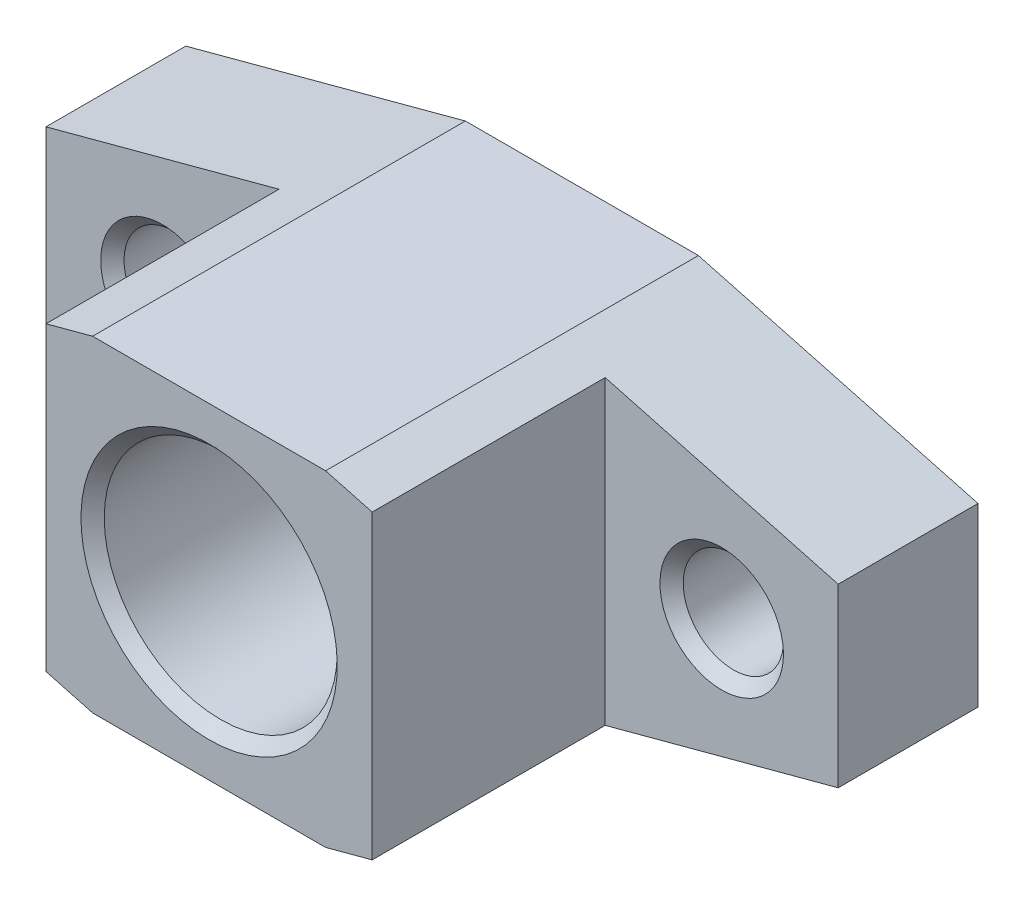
from build123d import *

# Parameters (mm, degrees)
EXTRUDE_1_DEPTH     = 6
EXTRUDE_2_DEPTH     = 16
HOLE_WIZARD_1_D     = 4.3
HOLE_WIZARD_1_DEPTH = 100
SKETCH_5_R          = 5
CUT_EXTRUDE_1_DEPTH = 25.372115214
CHAMFER_1_SIZE      = 0.5
CHAMFER_3_SIZE      = 0.5
MOVE_BODY_1_ANGLE   = 90


with BuildPart() as part:
    # Sketch 1 → Extrude 1 (new body)
    with BuildSketch(Plane(origin=(0, 0, 0), x_dir=(1, 0, 0), z_dir=(0, 1, 0))):
        Polygon((-5, 7), (5, 7), (17, 3.784609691), (17, -3.784609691), (5, -7), (-5, -7), (-17, -3.784609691), (-17, 3.784609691), align=None)
    extrude(amount=EXTRUDE_1_DEPTH)

    # Sketch 2 → Extrude 2 (add)
    with BuildSketch(Plane(origin=(0, 0, 0), x_dir=(-1, 0, 0), z_dir=(0, 1, 0))):
        Polygon((-5, 7), (5, 7), (7, 6.464101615), (7, -6.464101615), (5, -7), (-5, -7), (-7, -6.464101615), (-7, 6.464101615), align=None)
    extrude(amount=EXTRUDE_2_DEPTH)

    # Hole Wizard 1
    with Locations(Plane(origin=(0, 6, 0), x_dir=(-1, 0, 0), z_dir=(0, 1, 0))):
        with Locations((12, 0), (-12, 0)):
            Hole(HOLE_WIZARD_1_D / 2, depth=HOLE_WIZARD_1_DEPTH)

    # Sketch 5 → Cut-Extrude 1 (cut, through all)
    with BuildSketch(Plane(origin=(0, 16, 0), x_dir=(-1, 0, 0), z_dir=(0, 1, 0))):
        with Locations(Location((0, 0, 0), (0, 0, 90))):
            Circle(SKETCH_5_R)
    extrude(amount=-CUT_EXTRUDE_1_DEPTH, mode=Mode.SUBTRACT)

    # Chamfer 1
    chamfer_1_edges = [part.edges().sort_by_distance(p)[0] for p in [
        (0, 16, -5),
    ]]
    chamfer(chamfer_1_edges, length=CHAMFER_1_SIZE)

    # Chamfer 3
    chamfer_3_edges = [part.edges().sort_by_distance(p)[0] for p in [
        (9.85, 0, 0),
        (9.85, 6, 0),
        (-14.15, 0, 0),
        (-14.15, 6, 0),
        (0, 0, -5),
    ]]
    chamfer(chamfer_3_edges, length=CHAMFER_3_SIZE)


with BuildPart() as part_1:
    # Move Body 1: moved
    add(part.part.rotate(Axis((0, 0, 0), (1, 0, 0)), MOVE_BODY_1_ANGLE))


with BuildPart() as part_2:
    # Move Body 2: moved
    add(part_1.part.moved(Location((12, 0, 0))))


solid = part_2.part
